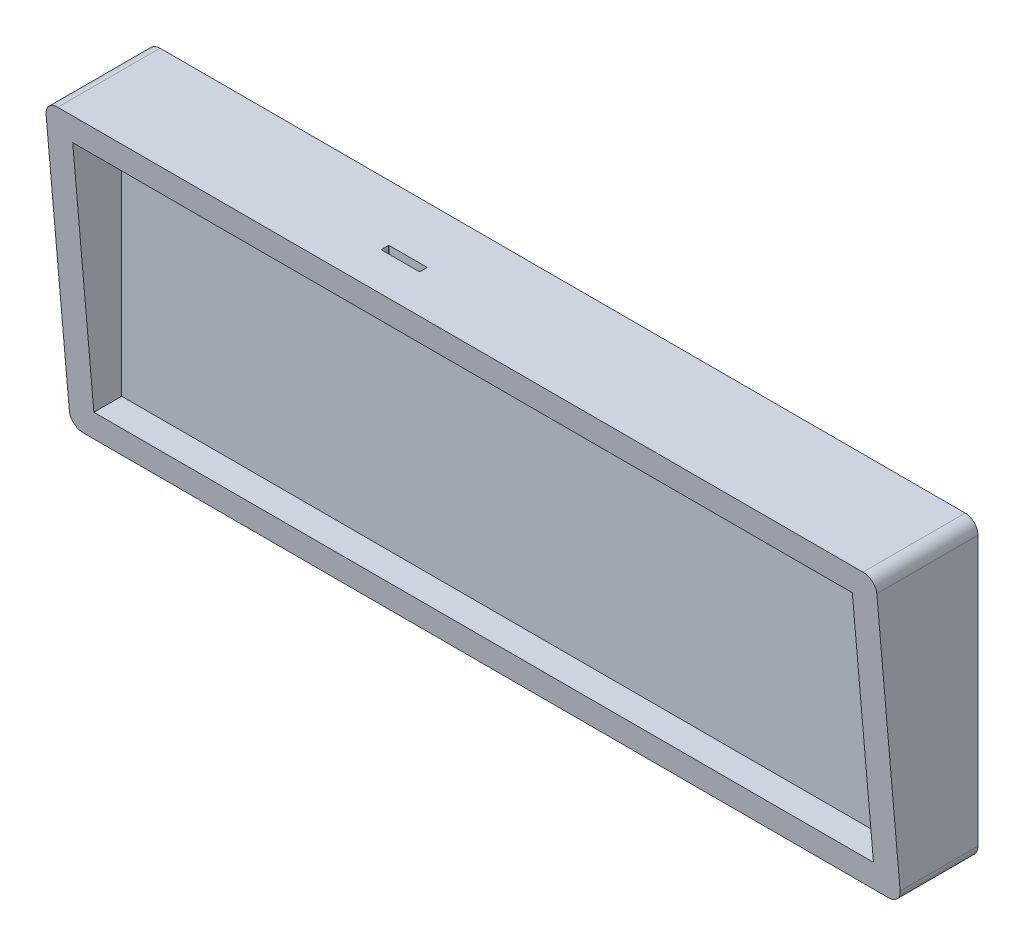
ISO-10303-21;
HEADER;
FILE_DESCRIPTION(('STEP AP214'),'2;1');
FILE_NAME('part.step','',(''),(''),'','','');
FILE_SCHEMA(('AUTOMOTIVE_DESIGN { 1 0 10303 214 1 1 1 1 }'));
ENDSEC;
DATA;
#1=APPLICATION_CONTEXT('core data for automotive mechanical design processes');
#2=APPLICATION_PROTOCOL_DEFINITION('international standard','automotive_design',2000,#1);
#3=PRODUCT_CONTEXT('',#1,'mechanical');
#4=PRODUCT('Part','Part','',(#3));
#5=PRODUCT_RELATED_PRODUCT_CATEGORY('part','',(#4));
#6=PRODUCT_DEFINITION_FORMATION('','',#4);
#7=PRODUCT_DEFINITION_CONTEXT('part definition',#1,'design');
#8=PRODUCT_DEFINITION('design','',#6,#7);
#9=PRODUCT_DEFINITION_SHAPE('','',#8);
#10=(LENGTH_UNIT() NAMED_UNIT(*) SI_UNIT(.MILLI.,.METRE.));
#11=(NAMED_UNIT(*) PLANE_ANGLE_UNIT() SI_UNIT($,.RADIAN.));
#12=(NAMED_UNIT(*) SI_UNIT($,.STERADIAN.) SOLID_ANGLE_UNIT());
#13=UNCERTAINTY_MEASURE_WITH_UNIT(LENGTH_MEASURE(1.E-05),#10,'distance_accuracy_value','');
#14=(GEOMETRIC_REPRESENTATION_CONTEXT(3) GLOBAL_UNCERTAINTY_ASSIGNED_CONTEXT((#13)) GLOBAL_UNIT_ASSIGNED_CONTEXT((#10,
#11,#12)) REPRESENTATION_CONTEXT('',''));
#15=CARTESIAN_POINT('',(0.,0.,0.));
#16=DIRECTION('',(0.,0.,1.));
#17=DIRECTION('',(1.,0.,0.));
#18=AXIS2_PLACEMENT_3D('',#15,#16,#17);
#19=CARTESIAN_POINT('',(-162.4,57.625,40.));
#20=DIRECTION('',(0.,-1.,0.));
#21=DIRECTION('',(0.,0.,-1.));
#22=AXIS2_PLACEMENT_3D('',#19,#20,#21);
#23=PLANE('',#22);
#24=DIRECTION('',(-1.,0.,0.));
#25=VECTOR('',#24,1.);
#26=CARTESIAN_POINT('',(-162.4,57.625,40.));
#27=LINE('',#26,#25);
#28=CARTESIAN_POINT('',(157.4,57.625,40.));
#29=VERTEX_POINT('',#28);
#30=CARTESIAN_POINT('',(-157.4,57.625,40.));
#31=VERTEX_POINT('',#30);
#32=EDGE_CURVE('E191',#29,#31,#27,.T.);
#33=ORIENTED_EDGE('',*,*,#32,.F.);
#34=DIRECTION('',(0.,0.,-1.));
#35=VECTOR('',#34,1.);
#36=CARTESIAN_POINT('',(157.4,57.625,40.));
#37=LINE('',#36,#35);
#38=CARTESIAN_POINT('',(157.4,57.625,0.));
#39=VERTEX_POINT('',#38);
#40=EDGE_CURVE('E295',#29,#39,#37,.T.);
#41=ORIENTED_EDGE('',*,*,#40,.T.);
#42=DIRECTION('',(-1.,0.,0.));
#43=VECTOR('',#42,1.);
#44=CARTESIAN_POINT('',(-162.4,57.625,0.));
#45=LINE('',#44,#43);
#46=CARTESIAN_POINT('',(-157.4,57.625,0.));
#47=VERTEX_POINT('',#46);
#48=EDGE_CURVE('E230',#39,#47,#45,.T.);
#49=ORIENTED_EDGE('',*,*,#48,.T.);
#50=DIRECTION('',(0.,0.,-1.));
#51=VECTOR('',#50,1.);
#52=CARTESIAN_POINT('',(-157.4,57.625,40.));
#53=LINE('',#52,#51);
#54=EDGE_CURVE('E292',#47,#31,#53,.F.);
#55=ORIENTED_EDGE('',*,*,#54,.T.);
#56=EDGE_LOOP('',(#33,#41,#49,#55));
#57=FACE_BOUND('',#56,.T.);
#58=DIRECTION('',(0.,0.,-1.));
#59=VECTOR('',#58,1.);
#60=CARTESIAN_POINT('',(-45.95,57.625,25.));
#61=LINE('',#60,#59);
#62=CARTESIAN_POINT('',(-45.95,57.625,24.9));
#63=VERTEX_POINT('',#62);
#64=CARTESIAN_POINT('',(-45.95,57.625,22.1));
#65=VERTEX_POINT('',#64);
#66=EDGE_CURVE('E381',#63,#65,#61,.T.);
#67=ORIENTED_EDGE('',*,*,#66,.T.);
#68=CARTESIAN_POINT('',(-45.85,57.625,22.1));
#69=DIRECTION('',(0.,-1.,0.));
#70=DIRECTION('',(0.,0.,-1.));
#71=AXIS2_PLACEMENT_3D('',#68,#69,#70);
#72=CIRCLE('',#71,0.1);
#73=CARTESIAN_POINT('',(-45.85,57.625,22.));
#74=VERTEX_POINT('',#73);
#75=EDGE_CURVE('E53',#65,#74,#72,.T.);
#76=ORIENTED_EDGE('',*,*,#75,.T.);
#77=DIRECTION('',(1.,0.,0.));
#78=VECTOR('',#77,1.);
#79=CARTESIAN_POINT('',(-45.95,57.625,22.));
#80=LINE('',#79,#78);
#81=CARTESIAN_POINT('',(-31.05,57.625,22.));
#82=VERTEX_POINT('',#81);
#83=EDGE_CURVE('E394',#74,#82,#80,.T.);
#84=ORIENTED_EDGE('',*,*,#83,.T.);
#85=CARTESIAN_POINT('',(-31.05,57.625,22.1));
#86=DIRECTION('',(0.,-1.,0.));
#87=DIRECTION('',(0.,0.,-1.));
#88=AXIS2_PLACEMENT_3D('',#85,#86,#87);
#89=CIRCLE('',#88,0.1);
#90=CARTESIAN_POINT('',(-30.95,57.625,22.1));
#91=VERTEX_POINT('',#90);
#92=EDGE_CURVE('E327',#82,#91,#89,.T.);
#93=ORIENTED_EDGE('',*,*,#92,.T.);
#94=DIRECTION('',(0.,0.,-1.));
#95=VECTOR('',#94,1.);
#96=CARTESIAN_POINT('',(-30.95,57.625,25.));
#97=LINE('',#96,#95);
#98=CARTESIAN_POINT('',(-30.95,57.625,24.9));
#99=VERTEX_POINT('',#98);
#100=EDGE_CURVE('E391',#99,#91,#97,.T.);
#101=ORIENTED_EDGE('',*,*,#100,.F.);
#102=CARTESIAN_POINT('',(-31.05,57.625,24.9));
#103=DIRECTION('',(0.,-1.,0.));
#104=DIRECTION('',(0.,0.,-1.));
#105=AXIS2_PLACEMENT_3D('',#102,#103,#104);
#106=CIRCLE('',#105,0.1);
#107=CARTESIAN_POINT('',(-31.05,57.625,25.));
#108=VERTEX_POINT('',#107);
#109=EDGE_CURVE('E342',#99,#108,#106,.T.);
#110=ORIENTED_EDGE('',*,*,#109,.T.);
#111=DIRECTION('',(1.,0.,0.));
#112=VECTOR('',#111,1.);
#113=CARTESIAN_POINT('',(-45.95,57.625,25.));
#114=LINE('',#113,#112);
#115=CARTESIAN_POINT('',(-45.85,57.625,25.));
#116=VERTEX_POINT('',#115);
#117=EDGE_CURVE('E387',#116,#108,#114,.T.);
#118=ORIENTED_EDGE('',*,*,#117,.F.);
#119=CARTESIAN_POINT('',(-45.85,57.625,24.9));
#120=DIRECTION('',(0.,-1.,0.));
#121=DIRECTION('',(0.,0.,-1.));
#122=AXIS2_PLACEMENT_3D('',#119,#120,#121);
#123=CIRCLE('',#122,0.1);
#124=EDGE_CURVE('E313',#116,#63,#123,.T.);
#125=ORIENTED_EDGE('',*,*,#124,.T.);
#126=EDGE_LOOP('',(#67,#76,#84,#93,#101,#110,#118,#125));
#127=FACE_BOUND('',#126,.T.);
#128=ADVANCED_FACE('F44',(#57,#127),#23,.F.);
#129=CARTESIAN_POINT('',(-152.4,47.725,20.));
#130=DIRECTION('',(0.,1.,0.));
#131=DIRECTION('',(0.,0.,1.));
#132=AXIS2_PLACEMENT_3D('',#129,#130,#131);
#133=PLANE('',#132);
#134=DIRECTION('',(0.,0.,1.));
#135=VECTOR('',#134,1.);
#136=CARTESIAN_POINT('',(152.4,47.725,20.));
#137=LINE('',#136,#135);
#138=CARTESIAN_POINT('',(152.4,47.725,20.));
#139=VERTEX_POINT('',#138);
#140=CARTESIAN_POINT('',(152.4,47.725,39.1409978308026));
#141=VERTEX_POINT('',#140);
#142=EDGE_CURVE('E197',#139,#141,#137,.T.);
#143=ORIENTED_EDGE('',*,*,#142,.T.);
#144=DIRECTION('',(-1.,0.,0.));
#145=VECTOR('',#144,1.);
#146=CARTESIAN_POINT('',(-152.4,47.725,39.1409978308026));
#147=LINE('',#146,#145);
#148=CARTESIAN_POINT('',(-152.4,47.725,39.1409978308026));
#149=VERTEX_POINT('',#148);
#150=EDGE_CURVE('E179',#141,#149,#147,.T.);
#151=ORIENTED_EDGE('',*,*,#150,.T.);
#152=DIRECTION('',(0.,0.,1.));
#153=VECTOR('',#152,1.);
#154=CARTESIAN_POINT('',(-152.4,47.725,20.));
#155=LINE('',#154,#153);
#156=CARTESIAN_POINT('',(-152.4,47.725,20.));
#157=VERTEX_POINT('',#156);
#158=EDGE_CURVE('E210',#157,#149,#155,.T.);
#159=ORIENTED_EDGE('',*,*,#158,.F.);
#160=DIRECTION('',(-1.,0.,0.));
#161=VECTOR('',#160,1.);
#162=CARTESIAN_POINT('',(-152.4,47.725,20.));
#163=LINE('',#162,#161);
#164=EDGE_CURVE('E207',#139,#157,#163,.T.);
#165=ORIENTED_EDGE('',*,*,#164,.F.);
#166=EDGE_LOOP('',(#143,#151,#159,#165));
#167=FACE_BOUND('',#166,.T.);
#168=DIRECTION('',(1.,0.,0.));
#169=VECTOR('',#168,1.);
#170=CARTESIAN_POINT('',(-152.4,47.725,22.));
#171=LINE('',#170,#169);
#172=CARTESIAN_POINT('',(-45.85,47.725,22.));
#173=VERTEX_POINT('',#172);
#174=CARTESIAN_POINT('',(-31.05,47.725,22.));
#175=VERTEX_POINT('',#174);
#176=EDGE_CURVE('E251',#173,#175,#171,.T.);
#177=ORIENTED_EDGE('',*,*,#176,.F.);
#178=CARTESIAN_POINT('',(-45.85,47.725,22.1));
#179=DIRECTION('',(0.,1.,0.));
#180=DIRECTION('',(0.,0.,1.));
#181=AXIS2_PLACEMENT_3D('',#178,#179,#180);
#182=CIRCLE('',#181,0.1);
#183=CARTESIAN_POINT('',(-45.95,47.725,22.1));
#184=VERTEX_POINT('',#183);
#185=EDGE_CURVE('E11',#173,#184,#182,.T.);
#186=ORIENTED_EDGE('',*,*,#185,.T.);
#187=DIRECTION('',(0.,0.,-1.));
#188=VECTOR('',#187,1.);
#189=CARTESIAN_POINT('',(-45.95,47.725,20.));
#190=LINE('',#189,#188);
#191=CARTESIAN_POINT('',(-45.95,47.725,24.9));
#192=VERTEX_POINT('',#191);
#193=EDGE_CURVE('E190',#192,#184,#190,.T.);
#194=ORIENTED_EDGE('',*,*,#193,.F.);
#195=CARTESIAN_POINT('',(-45.85,47.725,24.9));
#196=DIRECTION('',(0.,1.,0.));
#197=DIRECTION('',(0.,0.,1.));
#198=AXIS2_PLACEMENT_3D('',#195,#196,#197);
#199=CIRCLE('',#198,0.1);
#200=CARTESIAN_POINT('',(-45.85,47.725,25.));
#201=VERTEX_POINT('',#200);
#202=EDGE_CURVE('E316',#192,#201,#199,.T.);
#203=ORIENTED_EDGE('',*,*,#202,.T.);
#204=DIRECTION('',(1.,0.,0.));
#205=VECTOR('',#204,1.);
#206=CARTESIAN_POINT('',(-152.4,47.725,25.));
#207=LINE('',#206,#205);
#208=CARTESIAN_POINT('',(-31.05,47.725,25.));
#209=VERTEX_POINT('',#208);
#210=EDGE_CURVE('E244',#201,#209,#207,.T.);
#211=ORIENTED_EDGE('',*,*,#210,.T.);
#212=CARTESIAN_POINT('',(-31.05,47.725,24.9));
#213=DIRECTION('',(0.,1.,0.));
#214=DIRECTION('',(0.,0.,1.));
#215=AXIS2_PLACEMENT_3D('',#212,#213,#214);
#216=CIRCLE('',#215,0.1);
#217=CARTESIAN_POINT('',(-30.95,47.725,24.9));
#218=VERTEX_POINT('',#217);
#219=EDGE_CURVE('E345',#209,#218,#216,.T.);
#220=ORIENTED_EDGE('',*,*,#219,.T.);
#221=DIRECTION('',(0.,0.,-1.));
#222=VECTOR('',#221,1.);
#223=CARTESIAN_POINT('',(-30.95,47.725,20.));
#224=LINE('',#223,#222);
#225=CARTESIAN_POINT('',(-30.95,47.725,22.1));
#226=VERTEX_POINT('',#225);
#227=EDGE_CURVE('E248',#218,#226,#224,.T.);
#228=ORIENTED_EDGE('',*,*,#227,.T.);
#229=CARTESIAN_POINT('',(-31.05,47.725,22.1));
#230=DIRECTION('',(0.,1.,0.));
#231=DIRECTION('',(0.,0.,1.));
#232=AXIS2_PLACEMENT_3D('',#229,#230,#231);
#233=CIRCLE('',#232,0.1);
#234=EDGE_CURVE('E331',#226,#175,#233,.T.);
#235=ORIENTED_EDGE('',*,*,#234,.T.);
#236=EDGE_LOOP('',(#177,#186,#194,#203,#211,#220,#228,#235));
#237=FACE_BOUND('',#236,.T.);
#238=ADVANCED_FACE('F204',(#167,#237),#133,.F.);
#239=CARTESIAN_POINT('',(162.4,-57.625,40.));
#240=DIRECTION('',(-1.,0.,0.));
#241=DIRECTION('',(0.,0.,1.));
#242=AXIS2_PLACEMENT_3D('',#239,#240,#241);
#243=PLANE('',#242);
#244=DIRECTION('',(0.,-0.996256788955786,-0.0864431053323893));
#245=VECTOR('',#244,1.);
#246=CARTESIAN_POINT('',(162.4,-57.625,30.));
#247=LINE('',#246,#245);
#248=CARTESIAN_POINT('',(162.4,52.625,39.5661605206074));
#249=VERTEX_POINT('',#248);
#250=CARTESIAN_POINT('',(162.4,-52.625,30.4338394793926));
#251=VERTEX_POINT('',#250);
#252=EDGE_CURVE('E376',#249,#251,#247,.T.);
#253=ORIENTED_EDGE('',*,*,#252,.T.);
#254=DIRECTION('',(0.,0.,-1.));
#255=VECTOR('',#254,1.);
#256=CARTESIAN_POINT('',(162.4,-52.625,40.));
#257=LINE('',#256,#255);
#258=CARTESIAN_POINT('',(162.4,-52.625,0.));
#259=VERTEX_POINT('',#258);
#260=EDGE_CURVE('E257',#251,#259,#257,.T.);
#261=ORIENTED_EDGE('',*,*,#260,.T.);
#262=DIRECTION('',(0.,1.,0.));
#263=VECTOR('',#262,1.);
#264=CARTESIAN_POINT('',(162.4,-57.625,0.));
#265=LINE('',#264,#263);
#266=CARTESIAN_POINT('',(162.4,52.625,0.));
#267=VERTEX_POINT('',#266);
#268=EDGE_CURVE('E226',#259,#267,#265,.T.);
#269=ORIENTED_EDGE('',*,*,#268,.T.);
#270=DIRECTION('',(0.,0.,-1.));
#271=VECTOR('',#270,1.);
#272=CARTESIAN_POINT('',(162.4,52.625,40.));
#273=LINE('',#272,#271);
#274=EDGE_CURVE('E254',#267,#249,#273,.F.);
#275=ORIENTED_EDGE('',*,*,#274,.T.);
#276=EDGE_LOOP('',(#253,#261,#269,#275));
#277=FACE_BOUND('',#276,.T.);
#278=ADVANCED_FACE('F433',(#277),#243,.F.);
#279=CARTESIAN_POINT('',(-162.4,-57.625,40.));
#280=DIRECTION('',(1.,0.,0.));
#281=DIRECTION('',(0.,0.,-1.));
#282=AXIS2_PLACEMENT_3D('',#279,#280,#281);
#283=PLANE('',#282);
#284=DIRECTION('',(0.,-1.,0.));
#285=VECTOR('',#284,1.);
#286=CARTESIAN_POINT('',(-162.4,-57.625,0.));
#287=LINE('',#286,#285);
#288=CARTESIAN_POINT('',(-162.4,52.625,0.));
#289=VERTEX_POINT('',#288);
#290=CARTESIAN_POINT('',(-162.4,-52.625,0.));
#291=VERTEX_POINT('',#290);
#292=EDGE_CURVE('E234',#289,#291,#287,.T.);
#293=ORIENTED_EDGE('',*,*,#292,.T.);
#294=DIRECTION('',(0.,0.,-1.));
#295=VECTOR('',#294,1.);
#296=CARTESIAN_POINT('',(-162.4,-52.625,40.));
#297=LINE('',#296,#295);
#298=CARTESIAN_POINT('',(-162.4,-52.625,30.4338394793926));
#299=VERTEX_POINT('',#298);
#300=EDGE_CURVE('E303',#291,#299,#297,.F.);
#301=ORIENTED_EDGE('',*,*,#300,.T.);
#302=DIRECTION('',(0.,-0.996256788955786,-0.0864431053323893));
#303=VECTOR('',#302,1.);
#304=CARTESIAN_POINT('',(-162.4,-57.625,30.));
#305=LINE('',#304,#303);
#306=CARTESIAN_POINT('',(-162.4,52.625,39.5661605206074));
#307=VERTEX_POINT('',#306);
#308=EDGE_CURVE('E377',#307,#299,#305,.T.);
#309=ORIENTED_EDGE('',*,*,#308,.F.);
#310=DIRECTION('',(0.,0.,-1.));
#311=VECTOR('',#310,1.);
#312=CARTESIAN_POINT('',(-162.4,52.625,40.));
#313=LINE('',#312,#311);
#314=EDGE_CURVE('E299',#307,#289,#313,.T.);
#315=ORIENTED_EDGE('',*,*,#314,.T.);
#316=EDGE_LOOP('',(#293,#301,#309,#315));
#317=FACE_BOUND('',#316,.T.);
#318=ADVANCED_FACE('F438',(#317),#283,.F.);
#319=CARTESIAN_POINT('',(-162.4,-57.625,40.));
#320=DIRECTION('',(0.,1.,0.));
#321=DIRECTION('',(0.,0.,1.));
#322=AXIS2_PLACEMENT_3D('',#319,#320,#321);
#323=PLANE('',#322);
#324=DIRECTION('',(1.,0.,0.));
#325=VECTOR('',#324,1.);
#326=CARTESIAN_POINT('',(-162.4,-57.625,0.));
#327=LINE('',#326,#325);
#328=CARTESIAN_POINT('',(-157.4,-57.625,0.));
#329=VERTEX_POINT('',#328);
#330=CARTESIAN_POINT('',(157.4,-57.625,0.));
#331=VERTEX_POINT('',#330);
#332=EDGE_CURVE('E225',#329,#331,#327,.T.);
#333=ORIENTED_EDGE('',*,*,#332,.T.);
#334=DIRECTION('',(0.,0.,-1.));
#335=VECTOR('',#334,1.);
#336=CARTESIAN_POINT('',(157.4,-57.625,40.));
#337=LINE('',#336,#335);
#338=CARTESIAN_POINT('',(157.4,-57.625,30.));
#339=VERTEX_POINT('',#338);
#340=EDGE_CURVE('E277',#331,#339,#337,.F.);
#341=ORIENTED_EDGE('',*,*,#340,.T.);
#342=DIRECTION('',(-1.,0.,0.));
#343=VECTOR('',#342,1.);
#344=CARTESIAN_POINT('',(162.4,-57.625,30.));
#345=LINE('',#344,#343);
#346=CARTESIAN_POINT('',(-157.4,-57.625,30.));
#347=VERTEX_POINT('',#346);
#348=EDGE_CURVE('E372',#339,#347,#345,.T.);
#349=ORIENTED_EDGE('',*,*,#348,.T.);
#350=DIRECTION('',(0.,0.,-1.));
#351=VECTOR('',#350,1.);
#352=CARTESIAN_POINT('',(-157.4,-57.625,40.));
#353=LINE('',#352,#351);
#354=EDGE_CURVE('E273',#347,#329,#353,.T.);
#355=ORIENTED_EDGE('',*,*,#354,.T.);
#356=EDGE_LOOP('',(#333,#341,#349,#355));
#357=FACE_BOUND('',#356,.T.);
#358=ADVANCED_FACE('F498',(#357),#323,.F.);
#359=CARTESIAN_POINT('',(0.,0.,0.));
#360=DIRECTION('',(0.,0.,-1.));
#361=DIRECTION('',(-1.,0.,0.));
#362=AXIS2_PLACEMENT_3D('',#359,#360,#361);
#363=PLANE('',#362);
#364=ORIENTED_EDGE('',*,*,#268,.F.);
#365=CARTESIAN_POINT('',(157.4,-52.625,0.));
#366=DIRECTION('',(0.,0.,-1.));
#367=DIRECTION('',(-1.,0.,0.));
#368=AXIS2_PLACEMENT_3D('',#365,#366,#367);
#369=CIRCLE('',#368,5.);
#370=EDGE_CURVE('E270',#259,#331,#369,.T.);
#371=ORIENTED_EDGE('',*,*,#370,.T.);
#372=ORIENTED_EDGE('',*,*,#332,.F.);
#373=CARTESIAN_POINT('',(-157.4,-52.625,0.));
#374=DIRECTION('',(0.,0.,-1.));
#375=DIRECTION('',(-1.,0.,0.));
#376=AXIS2_PLACEMENT_3D('',#373,#374,#375);
#377=CIRCLE('',#376,5.);
#378=EDGE_CURVE('E264',#329,#291,#377,.T.);
#379=ORIENTED_EDGE('',*,*,#378,.T.);
#380=ORIENTED_EDGE('',*,*,#292,.F.);
#381=CARTESIAN_POINT('',(-157.4,52.625,0.));
#382=DIRECTION('',(0.,0.,-1.));
#383=DIRECTION('',(-1.,0.,0.));
#384=AXIS2_PLACEMENT_3D('',#381,#382,#383);
#385=CIRCLE('',#384,5.);
#386=EDGE_CURVE('E261',#289,#47,#385,.T.);
#387=ORIENTED_EDGE('',*,*,#386,.T.);
#388=ORIENTED_EDGE('',*,*,#48,.F.);
#389=CARTESIAN_POINT('',(157.4,52.625,0.));
#390=DIRECTION('',(0.,0.,-1.));
#391=DIRECTION('',(-1.,0.,0.));
#392=AXIS2_PLACEMENT_3D('',#389,#390,#391);
#393=CIRCLE('',#392,5.);
#394=EDGE_CURVE('E267',#39,#267,#393,.T.);
#395=ORIENTED_EDGE('',*,*,#394,.T.);
#396=EDGE_LOOP('',(#364,#371,#372,#379,#380,#387,#388,#395));
#397=FACE_BOUND('',#396,.T.);
#398=ADVANCED_FACE('F483',(#397),#363,.T.);
#399=CARTESIAN_POINT('',(162.4,-57.625,30.));
#400=DIRECTION('',(0.,0.0864431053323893,-0.996256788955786));
#401=DIRECTION('',(0.,0.996256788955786,0.0864431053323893));
#402=AXIS2_PLACEMENT_3D('',#399,#400,#401);
#403=PLANE('',#402);
#404=ORIENTED_EDGE('',*,*,#348,.F.);
#405=CARTESIAN_POINT('',(157.4,-52.625,30.4338394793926));
#406=DIRECTION('',(0.,0.0864431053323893,-0.996256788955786));
#407=DIRECTION('',(0.,-0.996256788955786,-0.0864431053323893));
#408=AXIS2_PLACEMENT_3D('',#405,#406,#407);
#409=ELLIPSE('',#408,5.01878637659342,5.);
#410=EDGE_CURVE('E289',#339,#251,#409,.F.);
#411=ORIENTED_EDGE('',*,*,#410,.T.);
#412=ORIENTED_EDGE('',*,*,#252,.F.);
#413=CARTESIAN_POINT('',(157.4,52.625,39.5661605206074));
#414=DIRECTION('',(0.,0.0864431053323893,-0.996256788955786));
#415=DIRECTION('',(0.,-0.996256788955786,-0.0864431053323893));
#416=AXIS2_PLACEMENT_3D('',#413,#414,#415);
#417=ELLIPSE('',#416,5.01878637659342,5.);
#418=EDGE_CURVE('E286',#249,#29,#417,.F.);
#419=ORIENTED_EDGE('',*,*,#418,.T.);
#420=ORIENTED_EDGE('',*,*,#32,.T.);
#421=CARTESIAN_POINT('',(-157.4,52.625,39.5661605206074));
#422=DIRECTION('',(0.,0.0864431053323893,-0.996256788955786));
#423=DIRECTION('',(0.,-0.996256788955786,-0.0864431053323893));
#424=AXIS2_PLACEMENT_3D('',#421,#422,#423);
#425=ELLIPSE('',#424,5.01878637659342,5.);
#426=EDGE_CURVE('E280',#31,#307,#425,.F.);
#427=ORIENTED_EDGE('',*,*,#426,.T.);
#428=ORIENTED_EDGE('',*,*,#308,.T.);
#429=CARTESIAN_POINT('',(-157.4,-52.625,30.4338394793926));
#430=DIRECTION('',(0.,0.0864431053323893,-0.996256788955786));
#431=DIRECTION('',(0.,-0.996256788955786,-0.0864431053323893));
#432=AXIS2_PLACEMENT_3D('',#429,#430,#431);
#433=ELLIPSE('',#432,5.01878637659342,5.);
#434=EDGE_CURVE('E283',#299,#347,#433,.F.);
#435=ORIENTED_EDGE('',*,*,#434,.T.);
#436=EDGE_LOOP('',(#404,#411,#412,#419,#420,#427,#428,#435));
#437=FACE_BOUND('',#436,.T.);
#438=DIRECTION('',(1.,0.,0.));
#439=VECTOR('',#438,1.);
#440=CARTESIAN_POINT('',(-152.4,-47.725,30.8590021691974));
#441=LINE('',#440,#439);
#442=CARTESIAN_POINT('',(-152.4,-47.725,30.8590021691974));
#443=VERTEX_POINT('',#442);
#444=CARTESIAN_POINT('',(152.4,-47.725,30.8590021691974));
#445=VERTEX_POINT('',#444);
#446=EDGE_CURVE('E202',#443,#445,#441,.T.);
#447=ORIENTED_EDGE('',*,*,#446,.F.);
#448=DIRECTION('',(0.,-0.996256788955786,-0.0864431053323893));
#449=VECTOR('',#448,1.);
#450=CARTESIAN_POINT('',(-152.4,-48.6601721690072,30.7778592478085));
#451=LINE('',#450,#449);
#452=EDGE_CURVE('E185',#149,#443,#451,.T.);
#453=ORIENTED_EDGE('',*,*,#452,.F.);
#454=ORIENTED_EDGE('',*,*,#150,.F.);
#455=DIRECTION('',(0.,0.996256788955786,0.0864431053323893));
#456=VECTOR('',#455,1.);
#457=CARTESIAN_POINT('',(152.4,-48.6601721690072,30.7778592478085));
#458=LINE('',#457,#456);
#459=EDGE_CURVE('E182',#445,#141,#458,.T.);
#460=ORIENTED_EDGE('',*,*,#459,.F.);
#461=EDGE_LOOP('',(#447,#453,#454,#460));
#462=FACE_BOUND('',#461,.T.);
#463=ADVANCED_FACE('F181',(#437,#462),#403,.F.);
#464=CARTESIAN_POINT('',(0.,0.,20.));
#465=DIRECTION('',(0.,0.,-1.));
#466=DIRECTION('',(-1.,0.,0.));
#467=AXIS2_PLACEMENT_3D('',#464,#465,#466);
#468=PLANE('',#467);
#469=DIRECTION('',(0.,1.,0.));
#470=VECTOR('',#469,1.);
#471=CARTESIAN_POINT('',(152.4,-47.725,20.));
#472=LINE('',#471,#470);
#473=CARTESIAN_POINT('',(152.4,-47.725,20.));
#474=VERTEX_POINT('',#473);
#475=EDGE_CURVE('E201',#474,#139,#472,.T.);
#476=ORIENTED_EDGE('',*,*,#475,.T.);
#477=ORIENTED_EDGE('',*,*,#164,.T.);
#478=DIRECTION('',(0.,-1.,0.));
#479=VECTOR('',#478,1.);
#480=CARTESIAN_POINT('',(-152.4,-47.725,20.));
#481=LINE('',#480,#479);
#482=CARTESIAN_POINT('',(-152.4,-47.725,20.));
#483=VERTEX_POINT('',#482);
#484=EDGE_CURVE('E218',#157,#483,#481,.T.);
#485=ORIENTED_EDGE('',*,*,#484,.T.);
#486=DIRECTION('',(1.,0.,0.));
#487=VECTOR('',#486,1.);
#488=CARTESIAN_POINT('',(-152.4,-47.725,20.));
#489=LINE('',#488,#487);
#490=EDGE_CURVE('E211',#483,#474,#489,.T.);
#491=ORIENTED_EDGE('',*,*,#490,.T.);
#492=EDGE_LOOP('',(#476,#477,#485,#491));
#493=FACE_BOUND('',#492,.T.);
#494=ADVANCED_FACE('F482',(#493),#468,.F.);
#495=CARTESIAN_POINT('',(-152.4,-47.725,20.));
#496=DIRECTION('',(-1.,0.,0.));
#497=DIRECTION('',(0.,0.,1.));
#498=AXIS2_PLACEMENT_3D('',#495,#496,#497);
#499=PLANE('',#498);
#500=ORIENTED_EDGE('',*,*,#158,.T.);
#501=ORIENTED_EDGE('',*,*,#452,.T.);
#502=DIRECTION('',(0.,0.,1.));
#503=VECTOR('',#502,1.);
#504=CARTESIAN_POINT('',(-152.4,-47.725,20.));
#505=LINE('',#504,#503);
#506=EDGE_CURVE('E215',#483,#443,#505,.T.);
#507=ORIENTED_EDGE('',*,*,#506,.F.);
#508=ORIENTED_EDGE('',*,*,#484,.F.);
#509=EDGE_LOOP('',(#500,#501,#507,#508));
#510=FACE_BOUND('',#509,.T.);
#511=ADVANCED_FACE('F487',(#510),#499,.F.);
#512=CARTESIAN_POINT('',(-152.4,-47.725,20.));
#513=DIRECTION('',(0.,-1.,0.));
#514=DIRECTION('',(0.,0.,-1.));
#515=AXIS2_PLACEMENT_3D('',#512,#513,#514);
#516=PLANE('',#515);
#517=ORIENTED_EDGE('',*,*,#506,.T.);
#518=ORIENTED_EDGE('',*,*,#446,.T.);
#519=DIRECTION('',(0.,0.,1.));
#520=VECTOR('',#519,1.);
#521=CARTESIAN_POINT('',(152.4,-47.725,20.));
#522=LINE('',#521,#520);
#523=EDGE_CURVE('E199',#474,#445,#522,.T.);
#524=ORIENTED_EDGE('',*,*,#523,.F.);
#525=ORIENTED_EDGE('',*,*,#490,.F.);
#526=EDGE_LOOP('',(#517,#518,#524,#525));
#527=FACE_BOUND('',#526,.T.);
#528=ADVANCED_FACE('F489',(#527),#516,.F.);
#529=CARTESIAN_POINT('',(152.4,-47.725,20.));
#530=DIRECTION('',(1.,0.,0.));
#531=DIRECTION('',(0.,0.,-1.));
#532=AXIS2_PLACEMENT_3D('',#529,#530,#531);
#533=PLANE('',#532);
#534=ORIENTED_EDGE('',*,*,#523,.T.);
#535=ORIENTED_EDGE('',*,*,#459,.T.);
#536=ORIENTED_EDGE('',*,*,#142,.F.);
#537=ORIENTED_EDGE('',*,*,#475,.F.);
#538=EDGE_LOOP('',(#534,#535,#536,#537));
#539=FACE_BOUND('',#538,.T.);
#540=ADVANCED_FACE('F195',(#539),#533,.F.);
#541=CARTESIAN_POINT('',(-45.95,7.625,22.));
#542=DIRECTION('',(0.,0.,1.));
#543=DIRECTION('',(1.,0.,0.));
#544=AXIS2_PLACEMENT_3D('',#541,#542,#543);
#545=PLANE('',#544);
#546=ORIENTED_EDGE('',*,*,#83,.F.);
#547=DIRECTION('',(0.,1.,0.));
#548=VECTOR('',#547,1.);
#549=CARTESIAN_POINT('',(-45.85,47.725,22.));
#550=LINE('',#549,#548);
#551=EDGE_CURVE('E66',#74,#173,#550,.F.);
#552=ORIENTED_EDGE('',*,*,#551,.T.);
#553=ORIENTED_EDGE('',*,*,#176,.T.);
#554=DIRECTION('',(0.,1.,0.));
#555=VECTOR('',#554,1.);
#556=CARTESIAN_POINT('',(-31.05,7.625,22.));
#557=LINE('',#556,#555);
#558=EDGE_CURVE('E319',#175,#82,#557,.T.);
#559=ORIENTED_EDGE('',*,*,#558,.T.);
#560=EDGE_LOOP('',(#546,#552,#553,#559));
#561=FACE_BOUND('',#560,.T.);
#562=ADVANCED_FACE('F403',(#561),#545,.T.);
#563=CARTESIAN_POINT('',(-30.95,7.625,25.));
#564=DIRECTION('',(1.,0.,0.));
#565=DIRECTION('',(0.,0.,-1.));
#566=AXIS2_PLACEMENT_3D('',#563,#564,#565);
#567=PLANE('',#566);
#568=ORIENTED_EDGE('',*,*,#227,.F.);
#569=DIRECTION('',(0.,1.,0.));
#570=VECTOR('',#569,1.);
#571=CARTESIAN_POINT('',(-30.95,57.625,24.9));
#572=LINE('',#571,#570);
#573=EDGE_CURVE('E335',#218,#99,#572,.T.);
#574=ORIENTED_EDGE('',*,*,#573,.T.);
#575=ORIENTED_EDGE('',*,*,#100,.T.);
#576=DIRECTION('',(0.,1.,0.));
#577=VECTOR('',#576,1.);
#578=CARTESIAN_POINT('',(-30.95,7.625,22.1));
#579=LINE('',#578,#577);
#580=EDGE_CURVE('E323',#91,#226,#579,.F.);
#581=ORIENTED_EDGE('',*,*,#580,.T.);
#582=EDGE_LOOP('',(#568,#574,#575,#581));
#583=FACE_BOUND('',#582,.T.);
#584=ADVANCED_FACE('F409',(#583),#567,.F.);
#585=CARTESIAN_POINT('',(-45.95,7.625,25.));
#586=DIRECTION('',(0.,0.,1.));
#587=DIRECTION('',(1.,0.,0.));
#588=AXIS2_PLACEMENT_3D('',#585,#586,#587);
#589=PLANE('',#588);
#590=ORIENTED_EDGE('',*,*,#117,.T.);
#591=DIRECTION('',(0.,1.,0.));
#592=VECTOR('',#591,1.);
#593=CARTESIAN_POINT('',(-31.05,47.725,25.));
#594=LINE('',#593,#592);
#595=EDGE_CURVE('E339',#108,#209,#594,.F.);
#596=ORIENTED_EDGE('',*,*,#595,.T.);
#597=ORIENTED_EDGE('',*,*,#210,.F.);
#598=DIRECTION('',(0.,1.,0.));
#599=VECTOR('',#598,1.);
#600=CARTESIAN_POINT('',(-45.85,7.625,25.));
#601=LINE('',#600,#599);
#602=EDGE_CURVE('E306',#201,#116,#601,.T.);
#603=ORIENTED_EDGE('',*,*,#602,.T.);
#604=EDGE_LOOP('',(#590,#596,#597,#603));
#605=FACE_BOUND('',#604,.T.);
#606=ADVANCED_FACE('F414',(#605),#589,.F.);
#607=CARTESIAN_POINT('',(-45.95,7.625,25.));
#608=DIRECTION('',(1.,0.,0.));
#609=DIRECTION('',(0.,0.,-1.));
#610=AXIS2_PLACEMENT_3D('',#607,#608,#609);
#611=PLANE('',#610);
#612=ORIENTED_EDGE('',*,*,#193,.T.);
#613=DIRECTION('',(0.,1.,0.));
#614=VECTOR('',#613,1.);
#615=CARTESIAN_POINT('',(-45.95,57.625,22.1));
#616=LINE('',#615,#614);
#617=EDGE_CURVE('E348',#184,#65,#616,.T.);
#618=ORIENTED_EDGE('',*,*,#617,.T.);
#619=ORIENTED_EDGE('',*,*,#66,.F.);
#620=DIRECTION('',(0.,1.,0.));
#621=VECTOR('',#620,1.);
#622=CARTESIAN_POINT('',(-45.95,7.625,24.9));
#623=LINE('',#622,#621);
#624=EDGE_CURVE('E310',#63,#192,#623,.F.);
#625=ORIENTED_EDGE('',*,*,#624,.T.);
#626=EDGE_LOOP('',(#612,#618,#619,#625));
#627=FACE_BOUND('',#626,.T.);
#628=ADVANCED_FACE('F447',(#627),#611,.T.);
#629=CARTESIAN_POINT('',(157.4,-52.625,40.));
#630=DIRECTION('',(0.,0.,-1.));
#631=DIRECTION('',(-1.,0.,0.));
#632=AXIS2_PLACEMENT_3D('',#629,#630,#631);
#633=CYLINDRICAL_SURFACE('',#632,5.);
#634=ORIENTED_EDGE('',*,*,#410,.F.);
#635=ORIENTED_EDGE('',*,*,#340,.F.);
#636=ORIENTED_EDGE('',*,*,#370,.F.);
#637=ORIENTED_EDGE('',*,*,#260,.F.);
#638=EDGE_LOOP('',(#634,#635,#636,#637));
#639=FACE_BOUND('',#638,.T.);
#640=ADVANCED_FACE('F443',(#639),#633,.T.);
#641=CARTESIAN_POINT('',(157.4,52.625,40.));
#642=DIRECTION('',(0.,0.,-1.));
#643=DIRECTION('',(-1.,0.,0.));
#644=AXIS2_PLACEMENT_3D('',#641,#642,#643);
#645=CYLINDRICAL_SURFACE('',#644,5.);
#646=ORIENTED_EDGE('',*,*,#418,.F.);
#647=ORIENTED_EDGE('',*,*,#274,.F.);
#648=ORIENTED_EDGE('',*,*,#394,.F.);
#649=ORIENTED_EDGE('',*,*,#40,.F.);
#650=EDGE_LOOP('',(#646,#647,#648,#649));
#651=FACE_BOUND('',#650,.T.);
#652=ADVANCED_FACE('F446',(#651),#645,.T.);
#653=CARTESIAN_POINT('',(-157.4,-52.625,40.));
#654=DIRECTION('',(0.,0.,-1.));
#655=DIRECTION('',(-1.,0.,0.));
#656=AXIS2_PLACEMENT_3D('',#653,#654,#655);
#657=CYLINDRICAL_SURFACE('',#656,5.);
#658=ORIENTED_EDGE('',*,*,#434,.F.);
#659=ORIENTED_EDGE('',*,*,#300,.F.);
#660=ORIENTED_EDGE('',*,*,#378,.F.);
#661=ORIENTED_EDGE('',*,*,#354,.F.);
#662=EDGE_LOOP('',(#658,#659,#660,#661));
#663=FACE_BOUND('',#662,.T.);
#664=ADVANCED_FACE('F451',(#663),#657,.T.);
#665=CARTESIAN_POINT('',(-157.4,52.625,40.));
#666=DIRECTION('',(0.,0.,-1.));
#667=DIRECTION('',(-1.,0.,0.));
#668=AXIS2_PLACEMENT_3D('',#665,#666,#667);
#669=CYLINDRICAL_SURFACE('',#668,5.);
#670=ORIENTED_EDGE('',*,*,#426,.F.);
#671=ORIENTED_EDGE('',*,*,#54,.F.);
#672=ORIENTED_EDGE('',*,*,#386,.F.);
#673=ORIENTED_EDGE('',*,*,#314,.F.);
#674=EDGE_LOOP('',(#670,#671,#672,#673));
#675=FACE_BOUND('',#674,.T.);
#676=ADVANCED_FACE('F455',(#675),#669,.T.);
#677=CARTESIAN_POINT('',(-45.85,7.625,24.9));
#678=DIRECTION('',(0.,1.,0.));
#679=DIRECTION('',(0.,0.,1.));
#680=AXIS2_PLACEMENT_3D('',#677,#678,#679);
#681=CYLINDRICAL_SURFACE('',#680,0.1);
#682=ORIENTED_EDGE('',*,*,#202,.F.);
#683=ORIENTED_EDGE('',*,*,#624,.F.);
#684=ORIENTED_EDGE('',*,*,#124,.F.);
#685=ORIENTED_EDGE('',*,*,#602,.F.);
#686=EDGE_LOOP('',(#682,#683,#684,#685));
#687=FACE_BOUND('',#686,.T.);
#688=ADVANCED_FACE('F426',(#687),#681,.F.);
#689=CARTESIAN_POINT('',(-31.05,7.625,22.1));
#690=DIRECTION('',(0.,1.,0.));
#691=DIRECTION('',(0.,0.,1.));
#692=AXIS2_PLACEMENT_3D('',#689,#690,#691);
#693=CYLINDRICAL_SURFACE('',#692,0.1);
#694=ORIENTED_EDGE('',*,*,#234,.F.);
#695=ORIENTED_EDGE('',*,*,#580,.F.);
#696=ORIENTED_EDGE('',*,*,#92,.F.);
#697=ORIENTED_EDGE('',*,*,#558,.F.);
#698=EDGE_LOOP('',(#694,#695,#696,#697));
#699=FACE_BOUND('',#698,.T.);
#700=ADVANCED_FACE('F402',(#699),#693,.F.);
#701=CARTESIAN_POINT('',(-31.05,7.625,24.9));
#702=DIRECTION('',(0.,-1.,0.));
#703=DIRECTION('',(0.,0.,-1.));
#704=AXIS2_PLACEMENT_3D('',#701,#702,#703);
#705=CYLINDRICAL_SURFACE('',#704,0.1);
#706=ORIENTED_EDGE('',*,*,#219,.F.);
#707=ORIENTED_EDGE('',*,*,#595,.F.);
#708=ORIENTED_EDGE('',*,*,#109,.F.);
#709=ORIENTED_EDGE('',*,*,#573,.F.);
#710=EDGE_LOOP('',(#706,#707,#708,#709));
#711=FACE_BOUND('',#710,.T.);
#712=ADVANCED_FACE('F417',(#711),#705,.F.);
#713=CARTESIAN_POINT('',(-45.85,7.625,22.1));
#714=DIRECTION('',(0.,-1.,0.));
#715=DIRECTION('',(0.,0.,-1.));
#716=AXIS2_PLACEMENT_3D('',#713,#714,#715);
#717=CYLINDRICAL_SURFACE('',#716,0.1);
#718=ORIENTED_EDGE('',*,*,#185,.F.);
#719=ORIENTED_EDGE('',*,*,#551,.F.);
#720=ORIENTED_EDGE('',*,*,#75,.F.);
#721=ORIENTED_EDGE('',*,*,#617,.F.);
#722=EDGE_LOOP('',(#718,#719,#720,#721));
#723=FACE_BOUND('',#722,.T.);
#724=ADVANCED_FACE('F46',(#723),#717,.F.);
#725=CLOSED_SHELL('',(#128,#238,#278,#318,#358,#398,#463,#494,#511,#528,#540,#562,#584,#606,
#628,#640,#652,#664,#676,#688,#700,#712,#724));
#726=MANIFOLD_SOLID_BREP('B2',#725);
#727=ADVANCED_BREP_SHAPE_REPRESENTATION('',(#18,#726),#14);
#728=SHAPE_DEFINITION_REPRESENTATION(#9,#727);
ENDSEC;
END-ISO-10303-21;
